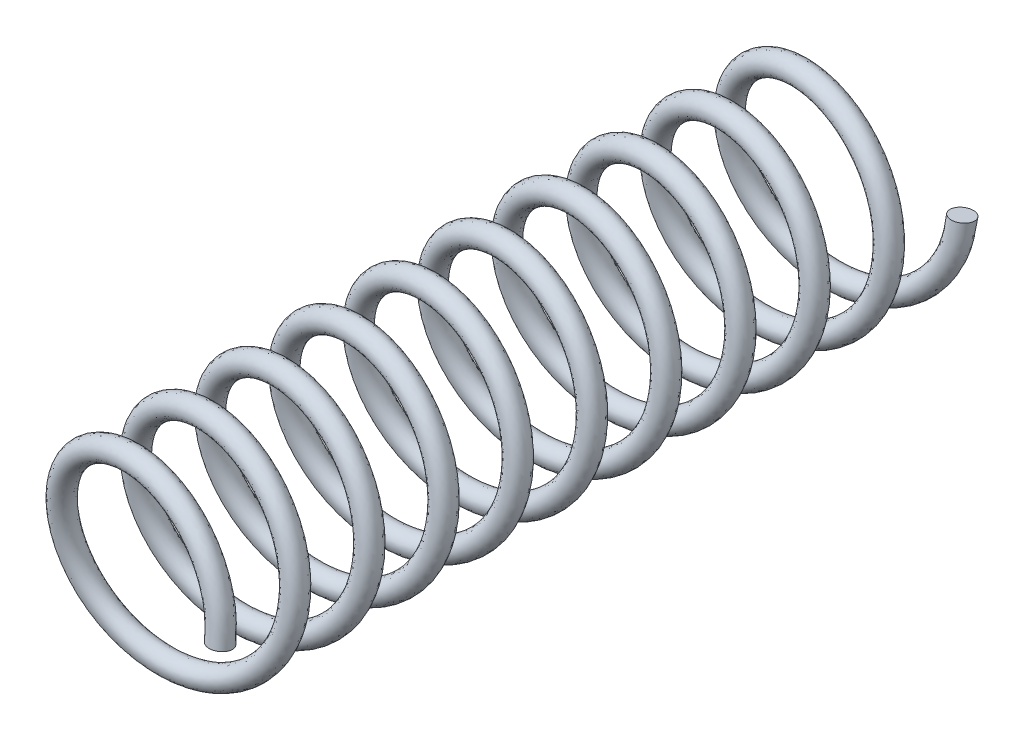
from build123d import *

# Parameters (mm, degrees)
BASE_BALAYAGE_PITCH  = 4
BASE_BALAYAGE_HEIGHT = 40
BASE_BALAYAGE_RADIUS = 5.25
ESQUISSE2_R          = 0.6


with BuildPart() as part:
    # Base-Balayage: sweep along a helix
    with BuildLine() as base_balayage_path:
        Helix(BASE_BALAYAGE_PITCH, BASE_BALAYAGE_HEIGHT, BASE_BALAYAGE_RADIUS, center=(0, 0, 0), direction=(0, 0, 1), lefthand=True)
    # Esquisse2 → Base-Balayage (sweep)
    with BuildSketch(Plane(origin=(5.25, 0, 0), x_dir=(1, 0, 0), z_dir=(0, -0.9927279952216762, 0.12037909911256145))):
        Circle(ESQUISSE2_R)
    sweep(path=base_balayage_path.line, is_frenet=True)


solid = part.part
